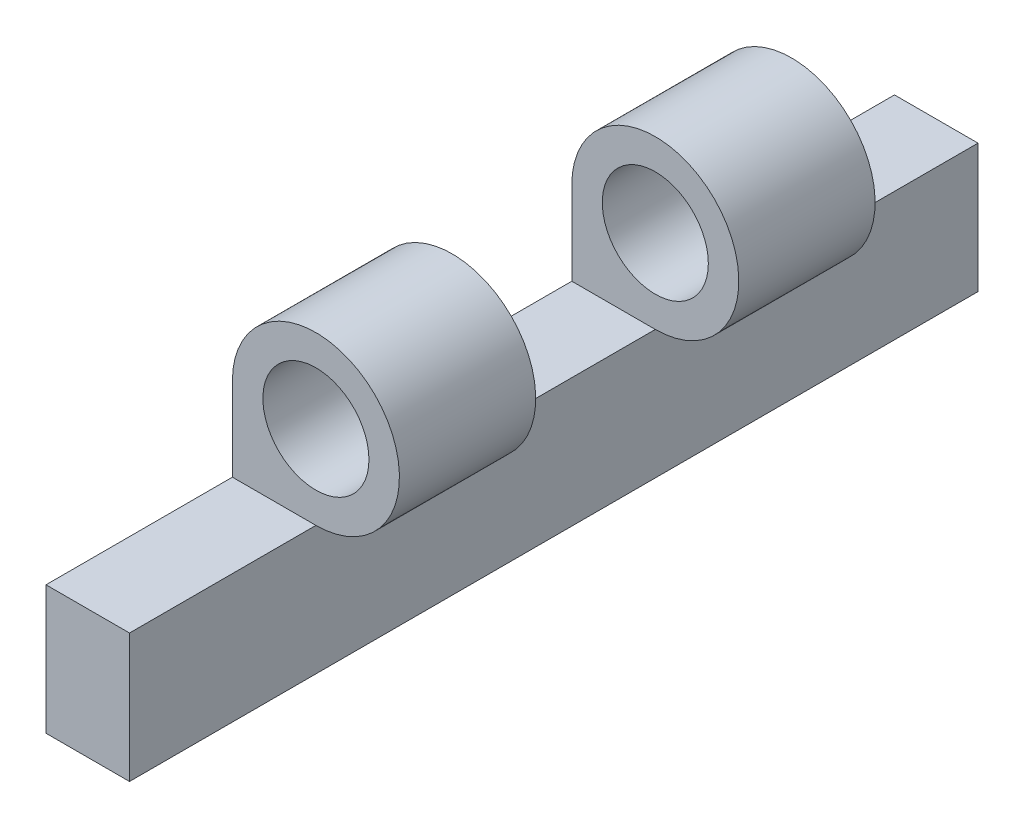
ISO-10303-21;
HEADER;
FILE_DESCRIPTION(('STEP AP214'),'2;1');
FILE_NAME('part.step','',(''),(''),'','','');
FILE_SCHEMA(('AUTOMOTIVE_DESIGN { 1 0 10303 214 1 1 1 1 }'));
ENDSEC;
DATA;
#1=APPLICATION_CONTEXT('core data for automotive mechanical design processes');
#2=APPLICATION_PROTOCOL_DEFINITION('international standard','automotive_design',2000,#1);
#3=PRODUCT_CONTEXT('',#1,'mechanical');
#4=PRODUCT('Part','Part','',(#3));
#5=PRODUCT_RELATED_PRODUCT_CATEGORY('part','',(#4));
#6=PRODUCT_DEFINITION_FORMATION('','',#4);
#7=PRODUCT_DEFINITION_CONTEXT('part definition',#1,'design');
#8=PRODUCT_DEFINITION('design','',#6,#7);
#9=PRODUCT_DEFINITION_SHAPE('','',#8);
#10=(LENGTH_UNIT() NAMED_UNIT(*) SI_UNIT(.MILLI.,.METRE.));
#11=(NAMED_UNIT(*) PLANE_ANGLE_UNIT() SI_UNIT($,.RADIAN.));
#12=(NAMED_UNIT(*) SI_UNIT($,.STERADIAN.) SOLID_ANGLE_UNIT());
#13=UNCERTAINTY_MEASURE_WITH_UNIT(LENGTH_MEASURE(1.E-05),#10,'distance_accuracy_value','');
#14=(GEOMETRIC_REPRESENTATION_CONTEXT(3) GLOBAL_UNCERTAINTY_ASSIGNED_CONTEXT((#13)) GLOBAL_UNIT_ASSIGNED_CONTEXT((#10,
#11,#12)) REPRESENTATION_CONTEXT('',''));
#15=CARTESIAN_POINT('',(0.,0.,0.));
#16=DIRECTION('',(0.,0.,1.));
#17=DIRECTION('',(1.,0.,0.));
#18=AXIS2_PLACEMENT_3D('',#15,#16,#17);
#19=CARTESIAN_POINT('',(0.,0.,25.4));
#20=DIRECTION('',(-1.,0.,0.));
#21=DIRECTION('',(0.,0.,1.));
#22=AXIS2_PLACEMENT_3D('',#19,#20,#21);
#23=PLANE('',#22);
#24=DIRECTION('',(0.,0.,1.));
#25=VECTOR('',#24,1.);
#26=CARTESIAN_POINT('',(0.,7.7,0.));
#27=LINE('',#26,#25);
#28=CARTESIAN_POINT('',(0.,7.7,14.24));
#29=VERTEX_POINT('',#28);
#30=CARTESIAN_POINT('',(0.,7.7,25.4));
#31=VERTEX_POINT('',#30);
#32=EDGE_CURVE('E117',#29,#31,#27,.T.);
#33=ORIENTED_EDGE('',*,*,#32,.F.);
#34=DIRECTION('',(0.,-1.,0.));
#35=VECTOR('',#34,1.);
#36=CARTESIAN_POINT('',(0.,0.,14.24));
#37=LINE('',#36,#35);
#38=CARTESIAN_POINT('',(0.,12.7,14.24));
#39=VERTEX_POINT('',#38);
#40=EDGE_CURVE('E127',#39,#29,#37,.T.);
#41=ORIENTED_EDGE('',*,*,#40,.F.);
#42=DIRECTION('',(0.,0.,-1.));
#43=VECTOR('',#42,1.);
#44=CARTESIAN_POINT('',(0.,12.7,25.4));
#45=LINE('',#44,#43);
#46=CARTESIAN_POINT('',(0.,12.7,6.08));
#47=VERTEX_POINT('',#46);
#48=EDGE_CURVE('E11',#39,#47,#45,.T.);
#49=ORIENTED_EDGE('',*,*,#48,.T.);
#50=DIRECTION('',(0.,-1.,0.));
#51=VECTOR('',#50,1.);
#52=CARTESIAN_POINT('',(0.,0.,6.07999999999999));
#53=LINE('',#52,#51);
#54=CARTESIAN_POINT('',(0.,7.7,6.07999999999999));
#55=VERTEX_POINT('',#54);
#56=EDGE_CURVE('E222',#47,#55,#53,.T.);
#57=ORIENTED_EDGE('',*,*,#56,.T.);
#58=DIRECTION('',(0.,0.,1.));
#59=VECTOR('',#58,1.);
#60=CARTESIAN_POINT('',(0.,7.7,0.));
#61=LINE('',#60,#59);
#62=CARTESIAN_POINT('',(0.,7.7,-6.08000000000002));
#63=VERTEX_POINT('',#62);
#64=EDGE_CURVE('E225',#63,#55,#61,.T.);
#65=ORIENTED_EDGE('',*,*,#64,.F.);
#66=DIRECTION('',(0.,-1.,0.));
#67=VECTOR('',#66,1.);
#68=CARTESIAN_POINT('',(0.,0.,-6.08000000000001));
#69=LINE('',#68,#67);
#70=CARTESIAN_POINT('',(0.,12.7,-6.08000000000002));
#71=VERTEX_POINT('',#70);
#72=EDGE_CURVE('E202',#71,#63,#69,.T.);
#73=ORIENTED_EDGE('',*,*,#72,.F.);
#74=CARTESIAN_POINT('',(0.,12.7,-14.24));
#75=VERTEX_POINT('',#74);
#76=EDGE_CURVE('E45',#71,#75,#45,.T.);
#77=ORIENTED_EDGE('',*,*,#76,.T.);
#78=DIRECTION('',(0.,-1.,0.));
#79=VECTOR('',#78,1.);
#80=CARTESIAN_POINT('',(0.,0.,-14.24));
#81=LINE('',#80,#79);
#82=CARTESIAN_POINT('',(0.,7.7,-14.24));
#83=VERTEX_POINT('',#82);
#84=EDGE_CURVE('E215',#75,#83,#81,.T.);
#85=ORIENTED_EDGE('',*,*,#84,.T.);
#86=DIRECTION('',(0.,0.,1.));
#87=VECTOR('',#86,1.);
#88=CARTESIAN_POINT('',(0.,7.7,0.));
#89=LINE('',#88,#87);
#90=CARTESIAN_POINT('',(0.,7.7,-25.4));
#91=VERTEX_POINT('',#90);
#92=EDGE_CURVE('E214',#91,#83,#89,.T.);
#93=ORIENTED_EDGE('',*,*,#92,.F.);
#94=DIRECTION('',(0.,1.,0.));
#95=VECTOR('',#94,1.);
#96=CARTESIAN_POINT('',(0.,0.,-25.4));
#97=LINE('',#96,#95);
#98=CARTESIAN_POINT('',(0.,0.,-25.4));
#99=VERTEX_POINT('',#98);
#100=EDGE_CURVE('E152',#99,#91,#97,.T.);
#101=ORIENTED_EDGE('',*,*,#100,.F.);
#102=DIRECTION('',(0.,0.,-1.));
#103=VECTOR('',#102,1.);
#104=CARTESIAN_POINT('',(0.,0.,25.4));
#105=LINE('',#104,#103);
#106=CARTESIAN_POINT('',(0.,0.,25.4));
#107=VERTEX_POINT('',#106);
#108=EDGE_CURVE('E140',#107,#99,#105,.T.);
#109=ORIENTED_EDGE('',*,*,#108,.F.);
#110=DIRECTION('',(0.,1.,0.));
#111=VECTOR('',#110,1.);
#112=CARTESIAN_POINT('',(0.,0.,25.4));
#113=LINE('',#112,#111);
#114=EDGE_CURVE('E134',#107,#31,#113,.T.);
#115=ORIENTED_EDGE('',*,*,#114,.T.);
#116=EDGE_LOOP('',(#33,#41,#49,#57,#65,#73,#77,#85,#93,#101,#109,#115));
#117=FACE_BOUND('',#116,.T.);
#118=ADVANCED_FACE('F36',(#117),#23,.T.);
#119=CARTESIAN_POINT('',(0.,0.,25.4));
#120=DIRECTION('',(0.,0.,-1.));
#121=DIRECTION('',(-1.,0.,0.));
#122=AXIS2_PLACEMENT_3D('',#119,#120,#121);
#123=PLANE('',#122);
#124=DIRECTION('',(1.,0.,0.));
#125=VECTOR('',#124,1.);
#126=CARTESIAN_POINT('',(0.,7.7,25.4));
#127=LINE('',#126,#125);
#128=CARTESIAN_POINT('',(5.,7.7,25.4));
#129=VERTEX_POINT('',#128);
#130=EDGE_CURVE('E120',#31,#129,#127,.T.);
#131=ORIENTED_EDGE('',*,*,#130,.F.);
#132=ORIENTED_EDGE('',*,*,#114,.F.);
#133=DIRECTION('',(-1.,0.,0.));
#134=VECTOR('',#133,1.);
#135=CARTESIAN_POINT('',(5.,0.,25.4));
#136=LINE('',#135,#134);
#137=CARTESIAN_POINT('',(5.,0.,25.4));
#138=VERTEX_POINT('',#137);
#139=EDGE_CURVE('E141',#138,#107,#136,.T.);
#140=ORIENTED_EDGE('',*,*,#139,.F.);
#141=DIRECTION('',(0.,1.,0.));
#142=VECTOR('',#141,1.);
#143=CARTESIAN_POINT('',(5.,0.,25.4));
#144=LINE('',#143,#142);
#145=EDGE_CURVE('E137',#138,#129,#144,.T.);
#146=ORIENTED_EDGE('',*,*,#145,.T.);
#147=EDGE_LOOP('',(#131,#132,#140,#146));
#148=FACE_BOUND('',#147,.T.);
#149=ADVANCED_FACE('F132',(#148),#123,.F.);
#150=CARTESIAN_POINT('',(0.,0.,-25.4));
#151=DIRECTION('',(0.,0.,-1.));
#152=DIRECTION('',(-1.,0.,0.));
#153=AXIS2_PLACEMENT_3D('',#150,#151,#152);
#154=PLANE('',#153);
#155=ORIENTED_EDGE('',*,*,#100,.T.);
#156=DIRECTION('',(1.,0.,0.));
#157=VECTOR('',#156,1.);
#158=CARTESIAN_POINT('',(0.,7.7,-25.4));
#159=LINE('',#158,#157);
#160=CARTESIAN_POINT('',(5.,7.7,-25.4));
#161=VERTEX_POINT('',#160);
#162=EDGE_CURVE('E209',#91,#161,#159,.T.);
#163=ORIENTED_EDGE('',*,*,#162,.T.);
#164=DIRECTION('',(0.,1.,0.));
#165=VECTOR('',#164,1.);
#166=CARTESIAN_POINT('',(5.,0.,-25.4));
#167=LINE('',#166,#165);
#168=CARTESIAN_POINT('',(5.,0.,-25.4));
#169=VERTEX_POINT('',#168);
#170=EDGE_CURVE('E149',#169,#161,#167,.T.);
#171=ORIENTED_EDGE('',*,*,#170,.F.);
#172=DIRECTION('',(-1.,0.,0.));
#173=VECTOR('',#172,1.);
#174=CARTESIAN_POINT('',(5.,0.,-25.4));
#175=LINE('',#174,#173);
#176=EDGE_CURVE('E145',#169,#99,#175,.T.);
#177=ORIENTED_EDGE('',*,*,#176,.T.);
#178=EDGE_LOOP('',(#155,#163,#171,#177));
#179=FACE_BOUND('',#178,.T.);
#180=ADVANCED_FACE('F208',(#179),#154,.T.);
#181=CARTESIAN_POINT('',(5.,12.7,25.4));
#182=DIRECTION('',(0.,0.,-1.));
#183=DIRECTION('',(-1.,0.,0.));
#184=AXIS2_PLACEMENT_3D('',#181,#182,#183);
#185=CYLINDRICAL_SURFACE('',#184,5.);
#186=CARTESIAN_POINT('',(5.,12.7,14.24));
#187=DIRECTION('',(0.,0.,1.));
#188=DIRECTION('',(0.,-1.,0.));
#189=AXIS2_PLACEMENT_3D('',#186,#187,#188);
#190=CIRCLE('',#189,5.);
#191=CARTESIAN_POINT('',(5.,7.7,14.24));
#192=VERTEX_POINT('',#191);
#193=EDGE_CURVE('E176',#192,#39,#190,.T.);
#194=ORIENTED_EDGE('',*,*,#193,.F.);
#195=DIRECTION('',(0.,0.,-1.));
#196=VECTOR('',#195,1.);
#197=CARTESIAN_POINT('',(5.,7.7,25.4));
#198=LINE('',#197,#196);
#199=CARTESIAN_POINT('',(5.,7.7,6.08));
#200=VERTEX_POINT('',#199);
#201=EDGE_CURVE('E178',#192,#200,#198,.T.);
#202=ORIENTED_EDGE('',*,*,#201,.T.);
#203=CARTESIAN_POINT('',(5.,12.7,6.08));
#204=DIRECTION('',(0.,0.,1.));
#205=DIRECTION('',(0.,-1.,0.));
#206=AXIS2_PLACEMENT_3D('',#203,#204,#205);
#207=CIRCLE('',#206,5.);
#208=EDGE_CURVE('E61',#200,#47,#207,.T.);
#209=ORIENTED_EDGE('',*,*,#208,.T.);
#210=ORIENTED_EDGE('',*,*,#48,.F.);
#211=EDGE_LOOP('',(#194,#202,#209,#210));
#212=FACE_BOUND('',#211,.T.);
#213=ADVANCED_FACE('F232',(#212),#185,.T.);
#214=CARTESIAN_POINT('',(5.,12.7,-6.08000000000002));
#215=DIRECTION('',(0.,0.,1.));
#216=DIRECTION('',(0.,-1.,0.));
#217=AXIS2_PLACEMENT_3D('',#214,#215,#216);
#218=CIRCLE('',#217,5.);
#219=CARTESIAN_POINT('',(5.,7.7,-6.08000000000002));
#220=VERTEX_POINT('',#219);
#221=EDGE_CURVE('E168',#220,#71,#218,.T.);
#222=ORIENTED_EDGE('',*,*,#221,.F.);
#223=CARTESIAN_POINT('',(5.,7.7,-14.24));
#224=VERTEX_POINT('',#223);
#225=EDGE_CURVE('E180',#220,#224,#198,.T.);
#226=ORIENTED_EDGE('',*,*,#225,.T.);
#227=CARTESIAN_POINT('',(5.,12.7,-14.24));
#228=DIRECTION('',(0.,0.,1.));
#229=DIRECTION('',(0.,-1.,0.));
#230=AXIS2_PLACEMENT_3D('',#227,#228,#229);
#231=CIRCLE('',#230,5.);
#232=EDGE_CURVE('E53',#224,#75,#231,.T.);
#233=ORIENTED_EDGE('',*,*,#232,.T.);
#234=ORIENTED_EDGE('',*,*,#76,.F.);
#235=EDGE_LOOP('',(#222,#226,#233,#234));
#236=FACE_BOUND('',#235,.T.);
#237=ADVANCED_FACE('F204',(#236),#185,.T.);
#238=CARTESIAN_POINT('',(5.,0.,25.4));
#239=DIRECTION('',(-1.,0.,0.));
#240=DIRECTION('',(0.,0.,1.));
#241=AXIS2_PLACEMENT_3D('',#238,#239,#240);
#242=PLANE('',#241);
#243=EDGE_CURVE('E153',#129,#192,#198,.T.);
#244=ORIENTED_EDGE('',*,*,#243,.F.);
#245=ORIENTED_EDGE('',*,*,#145,.F.);
#246=DIRECTION('',(0.,0.,-1.));
#247=VECTOR('',#246,1.);
#248=CARTESIAN_POINT('',(5.,0.,25.4));
#249=LINE('',#248,#247);
#250=EDGE_CURVE('E143',#138,#169,#249,.T.);
#251=ORIENTED_EDGE('',*,*,#250,.T.);
#252=ORIENTED_EDGE('',*,*,#170,.T.);
#253=EDGE_CURVE('E177',#224,#161,#198,.T.);
#254=ORIENTED_EDGE('',*,*,#253,.F.);
#255=ORIENTED_EDGE('',*,*,#225,.F.);
#256=EDGE_CURVE('E179',#200,#220,#198,.T.);
#257=ORIENTED_EDGE('',*,*,#256,.F.);
#258=ORIENTED_EDGE('',*,*,#201,.F.);
#259=EDGE_LOOP('',(#244,#245,#251,#252,#254,#255,#257,#258));
#260=FACE_BOUND('',#259,.T.);
#261=ADVANCED_FACE('F38',(#260),#242,.F.);
#262=CARTESIAN_POINT('',(5.,0.,25.4));
#263=DIRECTION('',(0.,-1.,0.));
#264=DIRECTION('',(0.,0.,-1.));
#265=AXIS2_PLACEMENT_3D('',#262,#263,#264);
#266=PLANE('',#265);
#267=ORIENTED_EDGE('',*,*,#176,.F.);
#268=ORIENTED_EDGE('',*,*,#250,.F.);
#269=ORIENTED_EDGE('',*,*,#139,.T.);
#270=ORIENTED_EDGE('',*,*,#108,.T.);
#271=EDGE_LOOP('',(#267,#268,#269,#270));
#272=FACE_BOUND('',#271,.T.);
#273=ADVANCED_FACE('F211',(#272),#266,.T.);
#274=CARTESIAN_POINT('',(0.,7.7,0.));
#275=DIRECTION('',(0.,1.,0.));
#276=DIRECTION('',(0.,0.,1.));
#277=AXIS2_PLACEMENT_3D('',#274,#275,#276);
#278=PLANE('',#277);
#279=ORIENTED_EDGE('',*,*,#253,.T.);
#280=ORIENTED_EDGE('',*,*,#162,.F.);
#281=ORIENTED_EDGE('',*,*,#92,.T.);
#282=DIRECTION('',(1.,0.,0.));
#283=VECTOR('',#282,1.);
#284=CARTESIAN_POINT('',(0.,7.7,-14.24));
#285=LINE('',#284,#283);
#286=EDGE_CURVE('E217',#83,#224,#285,.T.);
#287=ORIENTED_EDGE('',*,*,#286,.T.);
#288=EDGE_LOOP('',(#279,#280,#281,#287));
#289=FACE_BOUND('',#288,.T.);
#290=ADVANCED_FACE('F258',(#289),#278,.T.);
#291=CARTESIAN_POINT('',(0.,0.,-14.24));
#292=DIRECTION('',(0.,0.,1.));
#293=DIRECTION('',(0.,-1.,0.));
#294=AXIS2_PLACEMENT_3D('',#291,#292,#293);
#295=PLANE('',#294);
#296=CARTESIAN_POINT('',(5.,12.7,-14.24));
#297=DIRECTION('',(0.,0.,1.));
#298=DIRECTION('',(0.,-1.,0.));
#299=AXIS2_PLACEMENT_3D('',#296,#297,#298);
#300=CIRCLE('',#299,3.175);
#301=CARTESIAN_POINT('',(8.175,12.7,-14.24));
#302=VERTEX_POINT('',#301);
#303=EDGE_CURVE('E161',#302,#302,#300,.F.);
#304=ORIENTED_EDGE('',*,*,#303,.F.);
#305=EDGE_LOOP('',(#304));
#306=FACE_BOUND('',#305,.T.);
#307=ORIENTED_EDGE('',*,*,#286,.F.);
#308=ORIENTED_EDGE('',*,*,#84,.F.);
#309=ORIENTED_EDGE('',*,*,#232,.F.);
#310=EDGE_LOOP('',(#307,#308,#309));
#311=FACE_BOUND('',#310,.T.);
#312=ADVANCED_FACE('F265',(#306,#311),#295,.F.);
#313=CARTESIAN_POINT('',(0.,7.7,0.));
#314=DIRECTION('',(0.,1.,0.));
#315=DIRECTION('',(0.,0.,1.));
#316=AXIS2_PLACEMENT_3D('',#313,#314,#315);
#317=PLANE('',#316);
#318=ORIENTED_EDGE('',*,*,#256,.T.);
#319=DIRECTION('',(1.,0.,0.));
#320=VECTOR('',#319,1.);
#321=CARTESIAN_POINT('',(0.,7.7,-6.08000000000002));
#322=LINE('',#321,#320);
#323=EDGE_CURVE('E193',#63,#220,#322,.T.);
#324=ORIENTED_EDGE('',*,*,#323,.F.);
#325=ORIENTED_EDGE('',*,*,#64,.T.);
#326=DIRECTION('',(1.,0.,0.));
#327=VECTOR('',#326,1.);
#328=CARTESIAN_POINT('',(0.,7.7,6.07999999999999));
#329=LINE('',#328,#327);
#330=EDGE_CURVE('E196',#55,#200,#329,.T.);
#331=ORIENTED_EDGE('',*,*,#330,.T.);
#332=EDGE_LOOP('',(#318,#324,#325,#331));
#333=FACE_BOUND('',#332,.T.);
#334=ADVANCED_FACE('F192',(#333),#317,.T.);
#335=CARTESIAN_POINT('',(0.,0.,-6.08000000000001));
#336=DIRECTION('',(0.,0.,1.));
#337=DIRECTION('',(0.,-1.,0.));
#338=AXIS2_PLACEMENT_3D('',#335,#336,#337);
#339=PLANE('',#338);
#340=CARTESIAN_POINT('',(5.,12.7,-6.08000000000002));
#341=DIRECTION('',(0.,0.,1.));
#342=DIRECTION('',(0.,-1.,0.));
#343=AXIS2_PLACEMENT_3D('',#340,#341,#342);
#344=CIRCLE('',#343,3.175);
#345=CARTESIAN_POINT('',(8.175,12.7,-6.08000000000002));
#346=VERTEX_POINT('',#345);
#347=EDGE_CURVE('E166',#346,#346,#344,.F.);
#348=ORIENTED_EDGE('',*,*,#347,.T.);
#349=EDGE_LOOP('',(#348));
#350=FACE_BOUND('',#349,.T.);
#351=ORIENTED_EDGE('',*,*,#221,.T.);
#352=ORIENTED_EDGE('',*,*,#72,.T.);
#353=ORIENTED_EDGE('',*,*,#323,.T.);
#354=EDGE_LOOP('',(#351,#352,#353));
#355=FACE_BOUND('',#354,.T.);
#356=ADVANCED_FACE('F200',(#350,#355),#339,.T.);
#357=CARTESIAN_POINT('',(0.,0.,6.07999999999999));
#358=DIRECTION('',(0.,0.,1.));
#359=DIRECTION('',(0.,-1.,0.));
#360=AXIS2_PLACEMENT_3D('',#357,#358,#359);
#361=PLANE('',#360);
#362=CARTESIAN_POINT('',(5.,12.7,6.08));
#363=DIRECTION('',(0.,0.,1.));
#364=DIRECTION('',(0.,-1.,0.));
#365=AXIS2_PLACEMENT_3D('',#362,#363,#364);
#366=CIRCLE('',#365,3.175);
#367=CARTESIAN_POINT('',(8.175,12.7,6.07999999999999));
#368=VERTEX_POINT('',#367);
#369=EDGE_CURVE('E164',#368,#368,#366,.F.);
#370=ORIENTED_EDGE('',*,*,#369,.F.);
#371=EDGE_LOOP('',(#370));
#372=FACE_BOUND('',#371,.T.);
#373=ORIENTED_EDGE('',*,*,#330,.F.);
#374=ORIENTED_EDGE('',*,*,#56,.F.);
#375=ORIENTED_EDGE('',*,*,#208,.F.);
#376=EDGE_LOOP('',(#373,#374,#375));
#377=FACE_BOUND('',#376,.T.);
#378=ADVANCED_FACE('F230',(#372,#377),#361,.F.);
#379=CARTESIAN_POINT('',(0.,7.7,0.));
#380=DIRECTION('',(0.,1.,0.));
#381=DIRECTION('',(0.,0.,1.));
#382=AXIS2_PLACEMENT_3D('',#379,#380,#381);
#383=PLANE('',#382);
#384=ORIENTED_EDGE('',*,*,#243,.T.);
#385=DIRECTION('',(1.,0.,0.));
#386=VECTOR('',#385,1.);
#387=CARTESIAN_POINT('',(0.,7.7,14.24));
#388=LINE('',#387,#386);
#389=EDGE_CURVE('E123',#29,#192,#388,.T.);
#390=ORIENTED_EDGE('',*,*,#389,.F.);
#391=ORIENTED_EDGE('',*,*,#32,.T.);
#392=ORIENTED_EDGE('',*,*,#130,.T.);
#393=EDGE_LOOP('',(#384,#390,#391,#392));
#394=FACE_BOUND('',#393,.T.);
#395=ADVANCED_FACE('F119',(#394),#383,.T.);
#396=CARTESIAN_POINT('',(0.,0.,14.24));
#397=DIRECTION('',(0.,0.,1.));
#398=DIRECTION('',(0.,-1.,0.));
#399=AXIS2_PLACEMENT_3D('',#396,#397,#398);
#400=PLANE('',#399);
#401=CARTESIAN_POINT('',(5.,12.7,14.24));
#402=DIRECTION('',(0.,0.,1.));
#403=DIRECTION('',(0.,-1.,0.));
#404=AXIS2_PLACEMENT_3D('',#401,#402,#403);
#405=CIRCLE('',#404,3.175);
#406=CARTESIAN_POINT('',(8.175,12.7,14.24));
#407=VERTEX_POINT('',#406);
#408=EDGE_CURVE('E40',#407,#407,#405,.F.);
#409=ORIENTED_EDGE('',*,*,#408,.T.);
#410=EDGE_LOOP('',(#409));
#411=FACE_BOUND('',#410,.T.);
#412=ORIENTED_EDGE('',*,*,#193,.T.);
#413=ORIENTED_EDGE('',*,*,#40,.T.);
#414=ORIENTED_EDGE('',*,*,#389,.T.);
#415=EDGE_LOOP('',(#412,#413,#414));
#416=FACE_BOUND('',#415,.T.);
#417=ADVANCED_FACE('F234',(#411,#416),#400,.T.);
#418=CARTESIAN_POINT('',(5.,12.7,-25.4));
#419=DIRECTION('',(0.,0.,1.));
#420=DIRECTION('',(1.,0.,0.));
#421=AXIS2_PLACEMENT_3D('',#418,#419,#420);
#422=CYLINDRICAL_SURFACE('',#421,3.175);
#423=CARTESIAN_POINT('',(8.175,12.7,-14.24));
#424=CARTESIAN_POINT('',(8.175,12.7,-14.155));
#425=CARTESIAN_POINT('',(8.175,12.7,-14.07));
#426=CARTESIAN_POINT('',(8.175,12.7,-13.9));
#427=CARTESIAN_POINT('',(8.175,12.7,-13.815));
#428=CARTESIAN_POINT('',(8.175,12.7,-13.645));
#429=CARTESIAN_POINT('',(8.175,12.7,-13.56));
#430=CARTESIAN_POINT('',(8.175,12.7,-13.39));
#431=CARTESIAN_POINT('',(8.175,12.7,-13.305));
#432=CARTESIAN_POINT('',(8.175,12.7,-13.135));
#433=CARTESIAN_POINT('',(8.175,12.7,-13.05));
#434=CARTESIAN_POINT('',(8.175,12.7,-12.88));
#435=CARTESIAN_POINT('',(8.175,12.7,-12.795));
#436=CARTESIAN_POINT('',(8.175,12.7,-12.625));
#437=CARTESIAN_POINT('',(8.175,12.7,-12.54));
#438=CARTESIAN_POINT('',(8.175,12.7,-12.37));
#439=CARTESIAN_POINT('',(8.175,12.7,-12.285));
#440=CARTESIAN_POINT('',(8.175,12.7,-12.115));
#441=CARTESIAN_POINT('',(8.175,12.7,-12.03));
#442=CARTESIAN_POINT('',(8.175,12.7,-11.86));
#443=CARTESIAN_POINT('',(8.175,12.7,-11.775));
#444=CARTESIAN_POINT('',(8.175,12.7,-11.605));
#445=CARTESIAN_POINT('',(8.175,12.7,-11.52));
#446=CARTESIAN_POINT('',(8.175,12.7,-11.35));
#447=CARTESIAN_POINT('',(8.175,12.7,-11.265));
#448=CARTESIAN_POINT('',(8.175,12.7,-11.095));
#449=CARTESIAN_POINT('',(8.175,12.7,-11.01));
#450=CARTESIAN_POINT('',(8.175,12.7,-10.84));
#451=CARTESIAN_POINT('',(8.175,12.7,-10.755));
#452=CARTESIAN_POINT('',(8.175,12.7,-10.585));
#453=CARTESIAN_POINT('',(8.175,12.7,-10.5));
#454=CARTESIAN_POINT('',(8.175,12.7,-10.33));
#455=CARTESIAN_POINT('',(8.175,12.7,-10.245));
#456=CARTESIAN_POINT('',(8.175,12.7,-10.075));
#457=CARTESIAN_POINT('',(8.175,12.7,-9.99000000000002));
#458=CARTESIAN_POINT('',(8.175,12.7,-9.82000000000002));
#459=CARTESIAN_POINT('',(8.175,12.7,-9.73500000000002));
#460=CARTESIAN_POINT('',(8.175,12.7,-9.56500000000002));
#461=CARTESIAN_POINT('',(8.175,12.7,-9.48000000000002));
#462=CARTESIAN_POINT('',(8.175,12.7,-9.31000000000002));
#463=CARTESIAN_POINT('',(8.175,12.7,-9.22500000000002));
#464=CARTESIAN_POINT('',(8.175,12.7,-9.05500000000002));
#465=CARTESIAN_POINT('',(8.175,12.7,-8.97000000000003));
#466=CARTESIAN_POINT('',(8.175,12.7,-8.80000000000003));
#467=CARTESIAN_POINT('',(8.175,12.7,-8.71500000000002));
#468=CARTESIAN_POINT('',(8.175,12.7,-8.54500000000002));
#469=CARTESIAN_POINT('',(8.175,12.7,-8.46000000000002));
#470=CARTESIAN_POINT('',(8.175,12.7,-8.29000000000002));
#471=CARTESIAN_POINT('',(8.175,12.7,-8.20500000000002));
#472=CARTESIAN_POINT('',(8.175,12.7,-8.03500000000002));
#473=CARTESIAN_POINT('',(8.175,12.7,-7.95000000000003));
#474=CARTESIAN_POINT('',(8.175,12.7,-7.78000000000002));
#475=CARTESIAN_POINT('',(8.175,12.7,-7.69500000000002));
#476=CARTESIAN_POINT('',(8.175,12.7,-7.52500000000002));
#477=CARTESIAN_POINT('',(8.175,12.7,-7.44000000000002));
#478=CARTESIAN_POINT('',(8.175,12.7,-7.27000000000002));
#479=CARTESIAN_POINT('',(8.175,12.7,-7.18500000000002));
#480=CARTESIAN_POINT('',(8.175,12.7,-7.01500000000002));
#481=CARTESIAN_POINT('',(8.175,12.7,-6.93000000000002));
#482=CARTESIAN_POINT('',(8.175,12.7,-6.76000000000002));
#483=CARTESIAN_POINT('',(8.175,12.7,-6.67500000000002));
#484=CARTESIAN_POINT('',(8.175,12.7,-6.50500000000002));
#485=CARTESIAN_POINT('',(8.175,12.7,-6.42000000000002));
#486=CARTESIAN_POINT('',(8.175,12.7,-6.25000000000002));
#487=CARTESIAN_POINT('',(8.175,12.7,-6.16500000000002));
#488=CARTESIAN_POINT('',(8.175,12.7,-6.08000000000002));
#489=B_SPLINE_CURVE_WITH_KNOTS('',3,(#423,#424,#425,#426,#427,#428,#429,#430,#431,#432,#433,
#434,#435,#436,#437,#438,#439,#440,#441,#442,#443,#444,#445,#446,#447,#448,#449,#450,#451,#452,
#453,#454,#455,#456,#457,#458,#459,#460,#461,#462,#463,#464,#465,#466,#467,#468,#469,#470,#471,
#472,#473,#474,#475,#476,#477,#478,#479,#480,#481,#482,#483,#484,#485,#486,#487,#488),
.UNSPECIFIED.,.F.,.F.,(4,2,2,2,2,2,2,2,2,2,2,2,2,2,2,2,2,2,2,2,2,2,2,2,2,2,2,2,2,2,2,2,4),(0.,
0.255,0.51,0.765,1.02,1.275,1.53,1.785,2.04,2.295,2.55,2.805,3.06,3.315,3.57,3.825,4.08,4.335,
4.59,4.845,5.1,5.355,5.61,5.865,6.12,6.375,6.63,6.885,7.14,7.395,7.65,7.905,8.16),.UNSPECIFIED.);
#490=EDGE_CURVE('BSEAM237',#302,#346,#489,.T.);
#491=ORIENTED_EDGE('',*,*,#303,.T.);
#492=ORIENTED_EDGE('',*,*,#347,.F.);
#493=ORIENTED_EDGE('',*,*,#490,.T.);
#494=ORIENTED_EDGE('',*,*,#490,.F.);
#495=EDGE_LOOP('',(#491,#493,#492,#494));
#496=FACE_BOUND('',#495,.T.);
#497=ADVANCED_FACE('F237',(#496),#422,.F.);
#498=CARTESIAN_POINT('',(8.175,12.7,6.07999999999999));
#499=CARTESIAN_POINT('',(8.175,12.7,6.16499999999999));
#500=CARTESIAN_POINT('',(8.175,12.7,6.24999999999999));
#501=CARTESIAN_POINT('',(8.175,12.7,6.41999999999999));
#502=CARTESIAN_POINT('',(8.175,12.7,6.50499999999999));
#503=CARTESIAN_POINT('',(8.175,12.7,6.67499999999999));
#504=CARTESIAN_POINT('',(8.175,12.7,6.76));
#505=CARTESIAN_POINT('',(8.175,12.7,6.93));
#506=CARTESIAN_POINT('',(8.175,12.7,7.015));
#507=CARTESIAN_POINT('',(8.175,12.7,7.18499999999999));
#508=CARTESIAN_POINT('',(8.175,12.7,7.26999999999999));
#509=CARTESIAN_POINT('',(8.175,12.7,7.44));
#510=CARTESIAN_POINT('',(8.175,12.7,7.525));
#511=CARTESIAN_POINT('',(8.175,12.7,7.695));
#512=CARTESIAN_POINT('',(8.175,12.7,7.78));
#513=CARTESIAN_POINT('',(8.175,12.7,7.95));
#514=CARTESIAN_POINT('',(8.175,12.7,8.03499999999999));
#515=CARTESIAN_POINT('',(8.175,12.7,8.20499999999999));
#516=CARTESIAN_POINT('',(8.175,12.7,8.28999999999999));
#517=CARTESIAN_POINT('',(8.175,12.7,8.45999999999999));
#518=CARTESIAN_POINT('',(8.175,12.7,8.54499999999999));
#519=CARTESIAN_POINT('',(8.175,12.7,8.71499999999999));
#520=CARTESIAN_POINT('',(8.175,12.7,8.8));
#521=CARTESIAN_POINT('',(8.175,12.7,8.97));
#522=CARTESIAN_POINT('',(8.175,12.7,9.055));
#523=CARTESIAN_POINT('',(8.175,12.7,9.225));
#524=CARTESIAN_POINT('',(8.175,12.7,9.30999999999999));
#525=CARTESIAN_POINT('',(8.175,12.7,9.48));
#526=CARTESIAN_POINT('',(8.175,12.7,9.565));
#527=CARTESIAN_POINT('',(8.175,12.7,9.735));
#528=CARTESIAN_POINT('',(8.175,12.7,9.82));
#529=CARTESIAN_POINT('',(8.175,12.7,9.99));
#530=CARTESIAN_POINT('',(8.175,12.7,10.075));
#531=CARTESIAN_POINT('',(8.175,12.7,10.245));
#532=CARTESIAN_POINT('',(8.175,12.7,10.33));
#533=CARTESIAN_POINT('',(8.175,12.7,10.5));
#534=CARTESIAN_POINT('',(8.175,12.7,10.585));
#535=CARTESIAN_POINT('',(8.175,12.7,10.755));
#536=CARTESIAN_POINT('',(8.175,12.7,10.84));
#537=CARTESIAN_POINT('',(8.175,12.7,11.01));
#538=CARTESIAN_POINT('',(8.175,12.7,11.095));
#539=CARTESIAN_POINT('',(8.175,12.7,11.265));
#540=CARTESIAN_POINT('',(8.175,12.7,11.35));
#541=CARTESIAN_POINT('',(8.175,12.7,11.52));
#542=CARTESIAN_POINT('',(8.175,12.7,11.605));
#543=CARTESIAN_POINT('',(8.175,12.7,11.775));
#544=CARTESIAN_POINT('',(8.175,12.7,11.86));
#545=CARTESIAN_POINT('',(8.175,12.7,12.03));
#546=CARTESIAN_POINT('',(8.175,12.7,12.115));
#547=CARTESIAN_POINT('',(8.175,12.7,12.285));
#548=CARTESIAN_POINT('',(8.175,12.7,12.37));
#549=CARTESIAN_POINT('',(8.175,12.7,12.54));
#550=CARTESIAN_POINT('',(8.175,12.7,12.625));
#551=CARTESIAN_POINT('',(8.175,12.7,12.795));
#552=CARTESIAN_POINT('',(8.175,12.7,12.88));
#553=CARTESIAN_POINT('',(8.175,12.7,13.05));
#554=CARTESIAN_POINT('',(8.175,12.7,13.135));
#555=CARTESIAN_POINT('',(8.175,12.7,13.305));
#556=CARTESIAN_POINT('',(8.175,12.7,13.39));
#557=CARTESIAN_POINT('',(8.175,12.7,13.56));
#558=CARTESIAN_POINT('',(8.175,12.7,13.645));
#559=CARTESIAN_POINT('',(8.175,12.7,13.815));
#560=CARTESIAN_POINT('',(8.175,12.7,13.9));
#561=CARTESIAN_POINT('',(8.175,12.7,14.07));
#562=CARTESIAN_POINT('',(8.175,12.7,14.155));
#563=CARTESIAN_POINT('',(8.175,12.7,14.24));
#564=B_SPLINE_CURVE_WITH_KNOTS('',3,(#498,#499,#500,#501,#502,#503,#504,#505,#506,#507,#508,
#509,#510,#511,#512,#513,#514,#515,#516,#517,#518,#519,#520,#521,#522,#523,#524,#525,#526,#527,
#528,#529,#530,#531,#532,#533,#534,#535,#536,#537,#538,#539,#540,#541,#542,#543,#544,#545,#546,
#547,#548,#549,#550,#551,#552,#553,#554,#555,#556,#557,#558,#559,#560,#561,#562,#563),
.UNSPECIFIED.,.F.,.F.,(4,2,2,2,2,2,2,2,2,2,2,2,2,2,2,2,2,2,2,2,2,2,2,2,2,2,2,2,2,2,2,2,4),(0.,
0.254999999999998,0.509999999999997,0.765000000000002,1.02,1.275,1.53,1.785,2.04,2.295,2.55,
2.805,3.06,3.315,3.57,3.825,4.08,4.335,4.59,4.845,5.1,5.355,5.61,5.865,6.12,6.375,6.63,6.885,
7.14,7.395,7.65,7.905,8.16),.UNSPECIFIED.);
#565=EDGE_CURVE('BSEAM244',#368,#407,#564,.T.);
#566=ORIENTED_EDGE('',*,*,#369,.T.);
#567=ORIENTED_EDGE('',*,*,#408,.F.);
#568=ORIENTED_EDGE('',*,*,#565,.T.);
#569=ORIENTED_EDGE('',*,*,#565,.F.);
#570=EDGE_LOOP('',(#566,#568,#567,#569));
#571=FACE_BOUND('',#570,.T.);
#572=ADVANCED_FACE('F244',(#571),#422,.F.);
#573=CLOSED_SHELL('',(#118,#149,#180,#213,#237,#261,#273,#290,#312,#334,#356,#378,#395,#417,
#497,#572));
#574=MANIFOLD_SOLID_BREP('B2',#573);
#575=ADVANCED_BREP_SHAPE_REPRESENTATION('',(#18,#574),#14);
#576=SHAPE_DEFINITION_REPRESENTATION(#9,#575);
ENDSEC;
END-ISO-10303-21;
